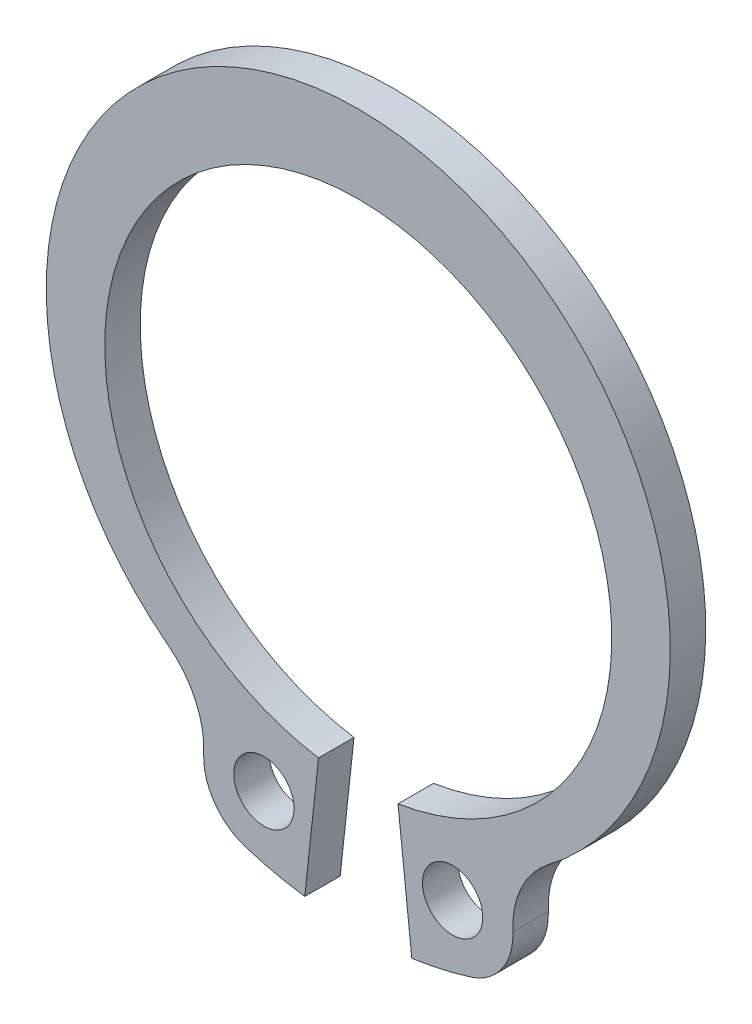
ISO-10303-21;
HEADER;
FILE_DESCRIPTION(('STEP AP214'),'2;1');
FILE_NAME('part.step','',(''),(''),'','','');
FILE_SCHEMA(('AUTOMOTIVE_DESIGN { 1 0 10303 214 1 1 1 1 }'));
ENDSEC;
DATA;
#1=APPLICATION_CONTEXT('core data for automotive mechanical design processes');
#2=APPLICATION_PROTOCOL_DEFINITION('international standard','automotive_design',2000,#1);
#3=PRODUCT_CONTEXT('',#1,'mechanical');
#4=PRODUCT('Part','Part','',(#3));
#5=PRODUCT_RELATED_PRODUCT_CATEGORY('part','',(#4));
#6=PRODUCT_DEFINITION_FORMATION('','',#4);
#7=PRODUCT_DEFINITION_CONTEXT('part definition',#1,'design');
#8=PRODUCT_DEFINITION('design','',#6,#7);
#9=PRODUCT_DEFINITION_SHAPE('','',#8);
#10=(LENGTH_UNIT() NAMED_UNIT(*) SI_UNIT(.MILLI.,.METRE.));
#11=(NAMED_UNIT(*) PLANE_ANGLE_UNIT() SI_UNIT($,.RADIAN.));
#12=(NAMED_UNIT(*) SI_UNIT($,.STERADIAN.) SOLID_ANGLE_UNIT());
#13=UNCERTAINTY_MEASURE_WITH_UNIT(LENGTH_MEASURE(1.E-05),#10,'distance_accuracy_value','');
#14=(GEOMETRIC_REPRESENTATION_CONTEXT(3) GLOBAL_UNCERTAINTY_ASSIGNED_CONTEXT((#13)) GLOBAL_UNIT_ASSIGNED_CONTEXT((#10,
#11,#12)) REPRESENTATION_CONTEXT('',''));
#15=CARTESIAN_POINT('',(0.,0.,0.));
#16=DIRECTION('',(0.,0.,1.));
#17=DIRECTION('',(1.,0.,0.));
#18=AXIS2_PLACEMENT_3D('',#15,#16,#17);
#19=CARTESIAN_POINT('',(0.,0.,1.));
#20=DIRECTION('',(0.,0.,1.));
#21=DIRECTION('',(1.,0.,0.));
#22=AXIS2_PLACEMENT_3D('',#19,#20,#21);
#23=PLANE('',#22);
#24=CARTESIAN_POINT('',(-2.66096124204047,-8.64691504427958,1.));
#25=DIRECTION('',(0.,0.,1.));
#26=DIRECTION('',(-1.,0.,0.));
#27=AXIS2_PLACEMENT_3D('',#24,#25,#26);
#28=CIRCLE('',#27,0.85);
#29=CARTESIAN_POINT('',(-3.51096124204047,-8.64691504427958,1.));
#30=VERTEX_POINT('',#29);
#31=EDGE_CURVE('E145',#30,#30,#28,.T.);
#32=ORIENTED_EDGE('',*,*,#31,.F.);
#33=EDGE_LOOP('',(#32));
#34=FACE_BOUND('',#33,.T.);
#35=CARTESIAN_POINT('',(0.,0.,1.));
#36=DIRECTION('',(0.,0.,-1.));
#37=DIRECTION('',(1.,0.,0.));
#38=AXIS2_PLACEMENT_3D('',#35,#36,#37);
#39=CIRCLE('',#38,7.15);
#40=CARTESIAN_POINT('',(-1.12089314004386,-7.06159320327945,1.));
#41=VERTEX_POINT('',#40);
#42=CARTESIAN_POINT('',(1.12089314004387,-7.06159320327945,1.));
#43=VERTEX_POINT('',#42);
#44=EDGE_CURVE('E160',#41,#43,#39,.T.);
#45=ORIENTED_EDGE('',*,*,#44,.T.);
#46=DIRECTION('',(0.107911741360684,-0.994160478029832,0.));
#47=VECTOR('',#46,1.);
#48=CARTESIAN_POINT('',(1.12089314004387,-7.06159320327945,1.));
#49=LINE('',#48,#47);
#50=CARTESIAN_POINT('',(1.50937540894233,-10.6405709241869,1.));
#51=VERTEX_POINT('',#50);
#52=EDGE_CURVE('E98',#43,#51,#49,.T.);
#53=ORIENTED_EDGE('',*,*,#52,.T.);
#54=CARTESIAN_POINT('',(0.,0.,1.));
#55=DIRECTION('',(0.,0.,1.));
#56=DIRECTION('',(1.,0.,0.));
#57=AXIS2_PLACEMENT_3D('',#54,#55,#56);
#58=CIRCLE('',#57,10.7470909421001);
#59=CARTESIAN_POINT('',(3.16097103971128,-10.2717197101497,1.));
#60=VERTEX_POINT('',#59);
#61=EDGE_CURVE('E181',#51,#60,#58,.T.);
#62=ORIENTED_EDGE('',*,*,#61,.T.);
#63=CARTESIAN_POINT('',(2.66096124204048,-8.64691504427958,1.));
#64=DIRECTION('',(0.,0.,1.));
#65=DIRECTION('',(1.,0.,0.));
#66=AXIS2_PLACEMENT_3D('',#63,#64,#65);
#67=CIRCLE('',#66,1.7);
#68=CARTESIAN_POINT('',(4.359257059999,-8.57081435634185,1.));
#69=VERTEX_POINT('',#68);
#70=EDGE_CURVE('E200',#60,#69,#67,.T.);
#71=ORIENTED_EDGE('',*,*,#70,.T.);
#72=CARTESIAN_POINT('',(6.90670078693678,-8.45666332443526,1.));
#73=DIRECTION('',(0.,0.,-1.));
#74=DIRECTION('',(1.,0.,0.));
#75=AXIS2_PLACEMENT_3D('',#72,#73,#74);
#76=CIRCLE('',#75,2.55);
#77=CARTESIAN_POINT('',(5.35497505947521,-6.43313984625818,1.));
#78=VERTEX_POINT('',#77);
#79=EDGE_CURVE('E197',#69,#78,#76,.T.);
#80=ORIENTED_EDGE('',*,*,#79,.T.);
#81=CARTESIAN_POINT('',(0.,0.549999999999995,1.));
#82=DIRECTION('',(0.,0.,1.));
#83=DIRECTION('',(1.,0.,0.));
#84=AXIS2_PLACEMENT_3D('',#81,#82,#83);
#85=CIRCLE('',#84,8.8);
#86=CARTESIAN_POINT('',(-5.35497505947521,-6.43313984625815,1.));
#87=VERTEX_POINT('',#86);
#88=EDGE_CURVE('E199',#78,#87,#85,.T.);
#89=ORIENTED_EDGE('',*,*,#88,.T.);
#90=CARTESIAN_POINT('',(-6.90670078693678,-8.45666332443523,1.));
#91=DIRECTION('',(0.,0.,-1.));
#92=DIRECTION('',(-1.,0.,0.));
#93=AXIS2_PLACEMENT_3D('',#90,#91,#92);
#94=CIRCLE('',#93,2.55);
#95=CARTESIAN_POINT('',(-4.359257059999,-8.57081435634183,1.));
#96=VERTEX_POINT('',#95);
#97=EDGE_CURVE('E123',#87,#96,#94,.T.);
#98=ORIENTED_EDGE('',*,*,#97,.T.);
#99=CARTESIAN_POINT('',(-2.66096124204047,-8.64691504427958,1.));
#100=DIRECTION('',(0.,0.,1.));
#101=DIRECTION('',(-1.,0.,0.));
#102=AXIS2_PLACEMENT_3D('',#99,#100,#101);
#103=CIRCLE('',#102,1.7);
#104=CARTESIAN_POINT('',(-3.16097103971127,-10.2717197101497,1.));
#105=VERTEX_POINT('',#104);
#106=EDGE_CURVE('E117',#96,#105,#103,.T.);
#107=ORIENTED_EDGE('',*,*,#106,.T.);
#108=CARTESIAN_POINT('',(0.,0.,1.));
#109=DIRECTION('',(0.,0.,1.));
#110=DIRECTION('',(-1.,0.,0.));
#111=AXIS2_PLACEMENT_3D('',#108,#109,#110);
#112=CIRCLE('',#111,10.7470909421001);
#113=CARTESIAN_POINT('',(-1.50937540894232,-10.6405709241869,1.));
#114=VERTEX_POINT('',#113);
#115=EDGE_CURVE('E121',#105,#114,#112,.T.);
#116=ORIENTED_EDGE('',*,*,#115,.T.);
#117=DIRECTION('',(0.107911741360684,0.994160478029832,0.));
#118=VECTOR('',#117,1.);
#119=CARTESIAN_POINT('',(-1.12089314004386,-7.06159320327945,1.));
#120=LINE('',#119,#118);
#121=EDGE_CURVE('E49',#114,#41,#120,.T.);
#122=ORIENTED_EDGE('',*,*,#121,.T.);
#123=EDGE_LOOP('',(#45,#53,#62,#71,#80,#89,#98,#107,#116,#122));
#124=FACE_BOUND('',#123,.T.);
#125=CARTESIAN_POINT('',(2.66096124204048,-8.64691504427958,1.));
#126=DIRECTION('',(0.,0.,1.));
#127=DIRECTION('',(1.,0.,0.));
#128=AXIS2_PLACEMENT_3D('',#125,#126,#127);
#129=CIRCLE('',#128,0.85);
#130=CARTESIAN_POINT('',(3.51096124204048,-8.64691504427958,1.));
#131=VERTEX_POINT('',#130);
#132=EDGE_CURVE('E211',#131,#131,#129,.T.);
#133=ORIENTED_EDGE('',*,*,#132,.F.);
#134=EDGE_LOOP('',(#133));
#135=FACE_BOUND('',#134,.T.);
#136=ADVANCED_FACE('F32',(#34,#124,#135),#23,.T.);
#137=CARTESIAN_POINT('',(0.,0.,0.));
#138=DIRECTION('',(0.,0.,1.));
#139=DIRECTION('',(1.,0.,0.));
#140=AXIS2_PLACEMENT_3D('',#137,#138,#139);
#141=PLANE('',#140);
#142=CARTESIAN_POINT('',(-2.66096124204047,-8.64691504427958,0.));
#143=DIRECTION('',(0.,0.,1.));
#144=DIRECTION('',(-1.,0.,0.));
#145=AXIS2_PLACEMENT_3D('',#142,#143,#144);
#146=CIRCLE('',#145,0.85);
#147=CARTESIAN_POINT('',(-3.51096124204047,-8.64691504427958,0.));
#148=VERTEX_POINT('',#147);
#149=EDGE_CURVE('E208',#148,#148,#146,.T.);
#150=ORIENTED_EDGE('',*,*,#149,.T.);
#151=EDGE_LOOP('',(#150));
#152=FACE_BOUND('',#151,.T.);
#153=CARTESIAN_POINT('',(0.,0.,0.));
#154=DIRECTION('',(0.,0.,-1.));
#155=DIRECTION('',(1.,0.,0.));
#156=AXIS2_PLACEMENT_3D('',#153,#154,#155);
#157=CIRCLE('',#156,7.15);
#158=CARTESIAN_POINT('',(-1.12089314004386,-7.06159320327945,0.));
#159=VERTEX_POINT('',#158);
#160=CARTESIAN_POINT('',(1.12089314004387,-7.06159320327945,0.));
#161=VERTEX_POINT('',#160);
#162=EDGE_CURVE('E141',#159,#161,#157,.T.);
#163=ORIENTED_EDGE('',*,*,#162,.F.);
#164=DIRECTION('',(0.107911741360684,0.994160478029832,0.));
#165=VECTOR('',#164,1.);
#166=CARTESIAN_POINT('',(-1.12089314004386,-7.06159320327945,0.));
#167=LINE('',#166,#165);
#168=CARTESIAN_POINT('',(-1.50937540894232,-10.6405709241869,0.));
#169=VERTEX_POINT('',#168);
#170=EDGE_CURVE('E90',#169,#159,#167,.T.);
#171=ORIENTED_EDGE('',*,*,#170,.F.);
#172=CARTESIAN_POINT('',(0.,0.,0.));
#173=DIRECTION('',(0.,0.,1.));
#174=DIRECTION('',(-1.,0.,0.));
#175=AXIS2_PLACEMENT_3D('',#172,#173,#174);
#176=CIRCLE('',#175,10.7470909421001);
#177=CARTESIAN_POINT('',(-3.16097103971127,-10.2717197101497,0.));
#178=VERTEX_POINT('',#177);
#179=EDGE_CURVE('E84',#178,#169,#176,.T.);
#180=ORIENTED_EDGE('',*,*,#179,.F.);
#181=CARTESIAN_POINT('',(-2.66096124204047,-8.64691504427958,0.));
#182=DIRECTION('',(0.,0.,1.));
#183=DIRECTION('',(-1.,0.,0.));
#184=AXIS2_PLACEMENT_3D('',#181,#182,#183);
#185=CIRCLE('',#184,1.7);
#186=CARTESIAN_POINT('',(-4.359257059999,-8.57081435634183,0.));
#187=VERTEX_POINT('',#186);
#188=EDGE_CURVE('E131',#187,#178,#185,.T.);
#189=ORIENTED_EDGE('',*,*,#188,.F.);
#190=CARTESIAN_POINT('',(-6.90670078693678,-8.45666332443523,0.));
#191=DIRECTION('',(0.,0.,-1.));
#192=DIRECTION('',(-1.,0.,0.));
#193=AXIS2_PLACEMENT_3D('',#190,#191,#192);
#194=CIRCLE('',#193,2.55);
#195=CARTESIAN_POINT('',(-5.35497505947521,-6.43313984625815,0.));
#196=VERTEX_POINT('',#195);
#197=EDGE_CURVE('E155',#196,#187,#194,.T.);
#198=ORIENTED_EDGE('',*,*,#197,.F.);
#199=CARTESIAN_POINT('',(0.,0.549999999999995,0.));
#200=DIRECTION('',(0.,0.,1.));
#201=DIRECTION('',(1.,0.,0.));
#202=AXIS2_PLACEMENT_3D('',#199,#200,#201);
#203=CIRCLE('',#202,8.8);
#204=CARTESIAN_POINT('',(5.35497505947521,-6.43313984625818,0.));
#205=VERTEX_POINT('',#204);
#206=EDGE_CURVE('E153',#205,#196,#203,.T.);
#207=ORIENTED_EDGE('',*,*,#206,.F.);
#208=CARTESIAN_POINT('',(6.90670078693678,-8.45666332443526,0.));
#209=DIRECTION('',(0.,0.,-1.));
#210=DIRECTION('',(1.,0.,0.));
#211=AXIS2_PLACEMENT_3D('',#208,#209,#210);
#212=CIRCLE('',#211,2.55);
#213=CARTESIAN_POINT('',(4.359257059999,-8.57081435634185,0.));
#214=VERTEX_POINT('',#213);
#215=EDGE_CURVE('E151',#214,#205,#212,.T.);
#216=ORIENTED_EDGE('',*,*,#215,.F.);
#217=CARTESIAN_POINT('',(2.66096124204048,-8.64691504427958,0.));
#218=DIRECTION('',(0.,0.,1.));
#219=DIRECTION('',(1.,0.,0.));
#220=AXIS2_PLACEMENT_3D('',#217,#218,#219);
#221=CIRCLE('',#220,1.7);
#222=CARTESIAN_POINT('',(3.16097103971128,-10.2717197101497,0.));
#223=VERTEX_POINT('',#222);
#224=EDGE_CURVE('E149',#223,#214,#221,.T.);
#225=ORIENTED_EDGE('',*,*,#224,.F.);
#226=CARTESIAN_POINT('',(0.,0.,0.));
#227=DIRECTION('',(0.,0.,1.));
#228=DIRECTION('',(1.,0.,0.));
#229=AXIS2_PLACEMENT_3D('',#226,#227,#228);
#230=CIRCLE('',#229,10.7470909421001);
#231=CARTESIAN_POINT('',(1.50937540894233,-10.6405709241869,0.));
#232=VERTEX_POINT('',#231);
#233=EDGE_CURVE('E147',#232,#223,#230,.T.);
#234=ORIENTED_EDGE('',*,*,#233,.F.);
#235=DIRECTION('',(0.107911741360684,-0.994160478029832,0.));
#236=VECTOR('',#235,1.);
#237=CARTESIAN_POINT('',(1.12089314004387,-7.06159320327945,0.));
#238=LINE('',#237,#236);
#239=EDGE_CURVE('E144',#161,#232,#238,.T.);
#240=ORIENTED_EDGE('',*,*,#239,.F.);
#241=EDGE_LOOP('',(#163,#171,#180,#189,#198,#207,#216,#225,#234,#240));
#242=FACE_BOUND('',#241,.T.);
#243=CARTESIAN_POINT('',(2.66096124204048,-8.64691504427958,0.));
#244=DIRECTION('',(0.,0.,1.));
#245=DIRECTION('',(1.,0.,0.));
#246=AXIS2_PLACEMENT_3D('',#243,#244,#245);
#247=CIRCLE('',#246,0.85);
#248=CARTESIAN_POINT('',(3.51096124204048,-8.64691504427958,0.));
#249=VERTEX_POINT('',#248);
#250=EDGE_CURVE('E214',#249,#249,#247,.T.);
#251=ORIENTED_EDGE('',*,*,#250,.T.);
#252=EDGE_LOOP('',(#251));
#253=FACE_BOUND('',#252,.T.);
#254=ADVANCED_FACE('F185',(#152,#242,#253),#141,.F.);
#255=CARTESIAN_POINT('',(0.,0.,1.));
#256=DIRECTION('',(0.,0.,-1.));
#257=DIRECTION('',(-1.,0.,0.));
#258=AXIS2_PLACEMENT_3D('',#255,#256,#257);
#259=CYLINDRICAL_SURFACE('',#258,7.15);
#260=ORIENTED_EDGE('',*,*,#162,.T.);
#261=DIRECTION('',(0.,0.,-1.));
#262=VECTOR('',#261,1.);
#263=CARTESIAN_POINT('',(1.12089314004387,-7.06159320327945,1.));
#264=LINE('',#263,#262);
#265=EDGE_CURVE('E11',#43,#161,#264,.T.);
#266=ORIENTED_EDGE('',*,*,#265,.F.);
#267=ORIENTED_EDGE('',*,*,#44,.F.);
#268=DIRECTION('',(0.,0.,-1.));
#269=VECTOR('',#268,1.);
#270=CARTESIAN_POINT('',(-1.12089314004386,-7.06159320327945,1.));
#271=LINE('',#270,#269);
#272=EDGE_CURVE('E137',#41,#159,#271,.T.);
#273=ORIENTED_EDGE('',*,*,#272,.T.);
#274=EDGE_LOOP('',(#260,#266,#267,#273));
#275=FACE_BOUND('',#274,.T.);
#276=ADVANCED_FACE('F34',(#275),#259,.F.);
#277=CARTESIAN_POINT('',(1.12089314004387,-7.06159320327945,1.));
#278=DIRECTION('',(0.994160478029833,0.107911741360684,0.));
#279=DIRECTION('',(-0.107911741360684,0.994160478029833,0.));
#280=AXIS2_PLACEMENT_3D('',#277,#278,#279);
#281=PLANE('',#280);
#282=ORIENTED_EDGE('',*,*,#239,.T.);
#283=DIRECTION('',(0.,0.,-1.));
#284=VECTOR('',#283,1.);
#285=CARTESIAN_POINT('',(1.50937540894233,-10.6405709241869,1.));
#286=LINE('',#285,#284);
#287=EDGE_CURVE('E41',#51,#232,#286,.T.);
#288=ORIENTED_EDGE('',*,*,#287,.F.);
#289=ORIENTED_EDGE('',*,*,#52,.F.);
#290=ORIENTED_EDGE('',*,*,#265,.T.);
#291=EDGE_LOOP('',(#282,#288,#289,#290));
#292=FACE_BOUND('',#291,.T.);
#293=ADVANCED_FACE('F255',(#292),#281,.F.);
#294=CARTESIAN_POINT('',(0.,0.,1.));
#295=DIRECTION('',(0.,0.,-1.));
#296=DIRECTION('',(-1.,0.,0.));
#297=AXIS2_PLACEMENT_3D('',#294,#295,#296);
#298=CYLINDRICAL_SURFACE('',#297,10.7470909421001);
#299=ORIENTED_EDGE('',*,*,#233,.T.);
#300=DIRECTION('',(0.,0.,-1.));
#301=VECTOR('',#300,1.);
#302=CARTESIAN_POINT('',(3.16097103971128,-10.2717197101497,1.));
#303=LINE('',#302,#301);
#304=EDGE_CURVE('E173',#60,#223,#303,.T.);
#305=ORIENTED_EDGE('',*,*,#304,.F.);
#306=ORIENTED_EDGE('',*,*,#61,.F.);
#307=ORIENTED_EDGE('',*,*,#287,.T.);
#308=EDGE_LOOP('',(#299,#305,#306,#307));
#309=FACE_BOUND('',#308,.T.);
#310=ADVANCED_FACE('F179',(#309),#298,.T.);
#311=CARTESIAN_POINT('',(2.66096124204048,-8.64691504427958,1.));
#312=DIRECTION('',(0.,0.,-1.));
#313=DIRECTION('',(-1.,0.,0.));
#314=AXIS2_PLACEMENT_3D('',#311,#312,#313);
#315=CYLINDRICAL_SURFACE('',#314,1.7);
#316=ORIENTED_EDGE('',*,*,#224,.T.);
#317=DIRECTION('',(0.,0.,-1.));
#318=VECTOR('',#317,1.);
#319=CARTESIAN_POINT('',(4.359257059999,-8.57081435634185,1.));
#320=LINE('',#319,#318);
#321=EDGE_CURVE('E170',#69,#214,#320,.T.);
#322=ORIENTED_EDGE('',*,*,#321,.F.);
#323=ORIENTED_EDGE('',*,*,#70,.F.);
#324=ORIENTED_EDGE('',*,*,#304,.T.);
#325=EDGE_LOOP('',(#316,#322,#323,#324));
#326=FACE_BOUND('',#325,.T.);
#327=ADVANCED_FACE('F191',(#326),#315,.T.);
#328=CARTESIAN_POINT('',(6.90670078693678,-8.45666332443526,1.));
#329=DIRECTION('',(0.,0.,-1.));
#330=DIRECTION('',(-1.,0.,0.));
#331=AXIS2_PLACEMENT_3D('',#328,#329,#330);
#332=CYLINDRICAL_SURFACE('',#331,2.55);
#333=ORIENTED_EDGE('',*,*,#215,.T.);
#334=DIRECTION('',(0.,0.,-1.));
#335=VECTOR('',#334,1.);
#336=CARTESIAN_POINT('',(5.35497505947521,-6.43313984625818,1.));
#337=LINE('',#336,#335);
#338=EDGE_CURVE('E167',#78,#205,#337,.T.);
#339=ORIENTED_EDGE('',*,*,#338,.F.);
#340=ORIENTED_EDGE('',*,*,#79,.F.);
#341=ORIENTED_EDGE('',*,*,#321,.T.);
#342=EDGE_LOOP('',(#333,#339,#340,#341));
#343=FACE_BOUND('',#342,.T.);
#344=ADVANCED_FACE('F195',(#343),#332,.F.);
#345=CARTESIAN_POINT('',(0.,0.549999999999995,1.));
#346=DIRECTION('',(0.,0.,-1.));
#347=DIRECTION('',(-1.,0.,0.));
#348=AXIS2_PLACEMENT_3D('',#345,#346,#347);
#349=CYLINDRICAL_SURFACE('',#348,8.8);
#350=ORIENTED_EDGE('',*,*,#206,.T.);
#351=DIRECTION('',(0.,0.,-1.));
#352=VECTOR('',#351,1.);
#353=CARTESIAN_POINT('',(-5.35497505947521,-6.43313984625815,1.));
#354=LINE('',#353,#352);
#355=EDGE_CURVE('E164',#87,#196,#354,.T.);
#356=ORIENTED_EDGE('',*,*,#355,.F.);
#357=ORIENTED_EDGE('',*,*,#88,.F.);
#358=ORIENTED_EDGE('',*,*,#338,.T.);
#359=EDGE_LOOP('',(#350,#356,#357,#358));
#360=FACE_BOUND('',#359,.T.);
#361=ADVANCED_FACE('F245',(#360),#349,.T.);
#362=CARTESIAN_POINT('',(-6.90670078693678,-8.45666332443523,1.));
#363=DIRECTION('',(0.,0.,-1.));
#364=DIRECTION('',(-1.,0.,0.));
#365=AXIS2_PLACEMENT_3D('',#362,#363,#364);
#366=CYLINDRICAL_SURFACE('',#365,2.55);
#367=ORIENTED_EDGE('',*,*,#197,.T.);
#368=DIRECTION('',(0.,0.,-1.));
#369=VECTOR('',#368,1.);
#370=CARTESIAN_POINT('',(-4.359257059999,-8.57081435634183,1.));
#371=LINE('',#370,#369);
#372=EDGE_CURVE('E132',#96,#187,#371,.T.);
#373=ORIENTED_EDGE('',*,*,#372,.F.);
#374=ORIENTED_EDGE('',*,*,#97,.F.);
#375=ORIENTED_EDGE('',*,*,#355,.T.);
#376=EDGE_LOOP('',(#367,#373,#374,#375));
#377=FACE_BOUND('',#376,.T.);
#378=ADVANCED_FACE('F242',(#377),#366,.F.);
#379=CARTESIAN_POINT('',(-2.66096124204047,-8.64691504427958,1.));
#380=DIRECTION('',(0.,0.,-1.));
#381=DIRECTION('',(-1.,0.,0.));
#382=AXIS2_PLACEMENT_3D('',#379,#380,#381);
#383=CYLINDRICAL_SURFACE('',#382,1.7);
#384=ORIENTED_EDGE('',*,*,#188,.T.);
#385=DIRECTION('',(0.,0.,-1.));
#386=VECTOR('',#385,1.);
#387=CARTESIAN_POINT('',(-3.16097103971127,-10.2717197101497,1.));
#388=LINE('',#387,#386);
#389=EDGE_CURVE('E128',#105,#178,#388,.T.);
#390=ORIENTED_EDGE('',*,*,#389,.F.);
#391=ORIENTED_EDGE('',*,*,#106,.F.);
#392=ORIENTED_EDGE('',*,*,#372,.T.);
#393=EDGE_LOOP('',(#384,#390,#391,#392));
#394=FACE_BOUND('',#393,.T.);
#395=ADVANCED_FACE('F129',(#394),#383,.T.);
#396=CARTESIAN_POINT('',(0.,0.,1.));
#397=DIRECTION('',(0.,0.,-1.));
#398=DIRECTION('',(-1.,0.,0.));
#399=AXIS2_PLACEMENT_3D('',#396,#397,#398);
#400=CYLINDRICAL_SURFACE('',#399,10.7470909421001);
#401=ORIENTED_EDGE('',*,*,#179,.T.);
#402=DIRECTION('',(0.,0.,-1.));
#403=VECTOR('',#402,1.);
#404=CARTESIAN_POINT('',(-1.50937540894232,-10.6405709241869,1.));
#405=LINE('',#404,#403);
#406=EDGE_CURVE('E133',#114,#169,#405,.T.);
#407=ORIENTED_EDGE('',*,*,#406,.F.);
#408=ORIENTED_EDGE('',*,*,#115,.F.);
#409=ORIENTED_EDGE('',*,*,#389,.T.);
#410=EDGE_LOOP('',(#401,#407,#408,#409));
#411=FACE_BOUND('',#410,.T.);
#412=ADVANCED_FACE('F135',(#411),#400,.T.);
#413=CARTESIAN_POINT('',(-1.12089314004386,-7.06159320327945,1.));
#414=DIRECTION('',(-0.994160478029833,0.107911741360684,0.));
#415=DIRECTION('',(-0.107911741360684,-0.994160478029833,0.));
#416=AXIS2_PLACEMENT_3D('',#413,#414,#415);
#417=PLANE('',#416);
#418=ORIENTED_EDGE('',*,*,#170,.T.);
#419=ORIENTED_EDGE('',*,*,#272,.F.);
#420=ORIENTED_EDGE('',*,*,#121,.F.);
#421=ORIENTED_EDGE('',*,*,#406,.T.);
#422=EDGE_LOOP('',(#418,#419,#420,#421));
#423=FACE_BOUND('',#422,.T.);
#424=ADVANCED_FACE('F235',(#423),#417,.F.);
#425=CARTESIAN_POINT('',(-2.66096124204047,-8.64691504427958,1.));
#426=DIRECTION('',(0.,0.,-1.));
#427=DIRECTION('',(-1.,0.,0.));
#428=AXIS2_PLACEMENT_3D('',#425,#426,#427);
#429=CYLINDRICAL_SURFACE('',#428,0.85);
#430=ORIENTED_EDGE('',*,*,#31,.T.);
#431=EDGE_LOOP('',(#430));
#432=FACE_BOUND('',#431,.T.);
#433=ORIENTED_EDGE('',*,*,#149,.F.);
#434=EDGE_LOOP('',(#433));
#435=FACE_BOUND('',#434,.T.);
#436=ADVANCED_FACE('F232',(#432,#435),#429,.F.);
#437=CARTESIAN_POINT('',(2.66096124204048,-8.64691504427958,1.));
#438=DIRECTION('',(0.,0.,-1.));
#439=DIRECTION('',(-1.,0.,0.));
#440=AXIS2_PLACEMENT_3D('',#437,#438,#439);
#441=CYLINDRICAL_SURFACE('',#440,0.85);
#442=ORIENTED_EDGE('',*,*,#132,.T.);
#443=EDGE_LOOP('',(#442));
#444=FACE_BOUND('',#443,.T.);
#445=ORIENTED_EDGE('',*,*,#250,.F.);
#446=EDGE_LOOP('',(#445));
#447=FACE_BOUND('',#446,.T.);
#448=ADVANCED_FACE('F220',(#444,#447),#441,.F.);
#449=CLOSED_SHELL('',(#136,#254,#276,#293,#310,#327,#344,#361,#378,#395,#412,#424,#436,#448));
#450=MANIFOLD_SOLID_BREP('B2',#449);
#451=ADVANCED_BREP_SHAPE_REPRESENTATION('',(#18,#450),#14);
#452=SHAPE_DEFINITION_REPRESENTATION(#9,#451);
ENDSEC;
END-ISO-10303-21;
